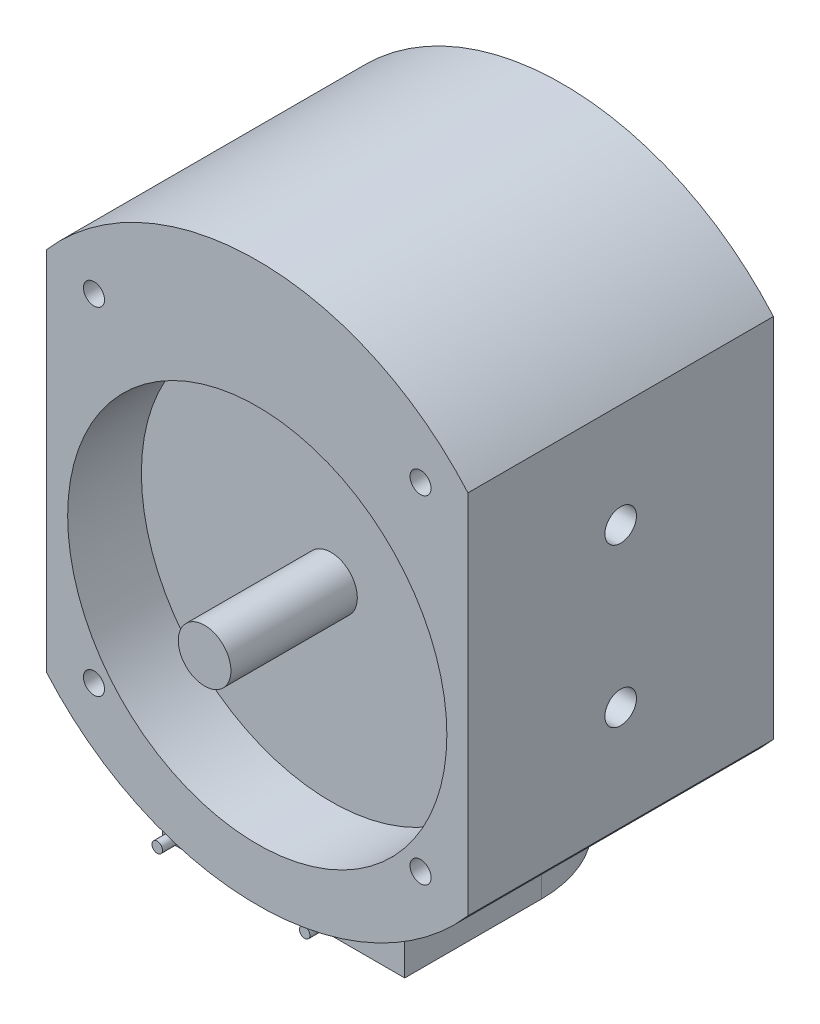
ISO-10303-21;
HEADER;
FILE_DESCRIPTION(('STEP AP214'),'2;1');
FILE_NAME('part.step','',(''),(''),'','','');
FILE_SCHEMA(('AUTOMOTIVE_DESIGN { 1 0 10303 214 1 1 1 1 }'));
ENDSEC;
DATA;
#1=APPLICATION_CONTEXT('core data for automotive mechanical design processes');
#2=APPLICATION_PROTOCOL_DEFINITION('international standard','automotive_design',2000,#1);
#3=PRODUCT_CONTEXT('',#1,'mechanical');
#4=PRODUCT('Part','Part','',(#3));
#5=PRODUCT_RELATED_PRODUCT_CATEGORY('part','',(#4));
#6=PRODUCT_DEFINITION_FORMATION('','',#4);
#7=PRODUCT_DEFINITION_CONTEXT('part definition',#1,'design');
#8=PRODUCT_DEFINITION('design','',#6,#7);
#9=PRODUCT_DEFINITION_SHAPE('','',#8);
#10=(LENGTH_UNIT() NAMED_UNIT(*) SI_UNIT(.MILLI.,.METRE.));
#11=(NAMED_UNIT(*) PLANE_ANGLE_UNIT() SI_UNIT($,.RADIAN.));
#12=(NAMED_UNIT(*) SI_UNIT($,.STERADIAN.) SOLID_ANGLE_UNIT());
#13=UNCERTAINTY_MEASURE_WITH_UNIT(LENGTH_MEASURE(1.E-05),#10,'distance_accuracy_value','');
#14=(GEOMETRIC_REPRESENTATION_CONTEXT(3) GLOBAL_UNCERTAINTY_ASSIGNED_CONTEXT((#13)) GLOBAL_UNIT_ASSIGNED_CONTEXT((#10,
#11,#12)) REPRESENTATION_CONTEXT('',''));
#15=CARTESIAN_POINT('',(0.,0.,0.));
#16=DIRECTION('',(0.,0.,1.));
#17=DIRECTION('',(1.,0.,0.));
#18=AXIS2_PLACEMENT_3D('',#15,#16,#17);
#19=CARTESIAN_POINT('',(0.,0.,5.));
#20=DIRECTION('',(0.,0.,1.));
#21=DIRECTION('',(1.,0.,0.));
#22=AXIS2_PLACEMENT_3D('',#19,#20,#21);
#23=PLANE('',#22);
#24=CARTESIAN_POINT('',(0.,0.,5.));
#25=DIRECTION('',(0.,0.,1.));
#26=DIRECTION('',(1.,0.,0.));
#27=AXIS2_PLACEMENT_3D('',#24,#25,#26);
#28=CIRCLE('',#27,2.5);
#29=CARTESIAN_POINT('',(2.5,0.,5.));
#30=VERTEX_POINT('',#29);
#31=EDGE_CURVE('E20',#30,#30,#28,.F.);
#32=ORIENTED_EDGE('',*,*,#31,.F.);
#33=EDGE_LOOP('',(#32));
#34=FACE_BOUND('',#33,.T.);
#35=ADVANCED_FACE('F17',(#34),#23,.T.);
#36=CARTESIAN_POINT('',(0.,0.,-46.0710678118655));
#37=DIRECTION('',(0.,0.,1.));
#38=DIRECTION('',(1.,0.,0.));
#39=AXIS2_PLACEMENT_3D('',#36,#37,#38);
#40=CYLINDRICAL_SURFACE('',#39,2.5);
#41=CARTESIAN_POINT('',(0.,0.,-7.));
#42=DIRECTION('',(0.,0.,1.));
#43=DIRECTION('',(1.,0.,0.));
#44=AXIS2_PLACEMENT_3D('',#41,#42,#43);
#45=CIRCLE('',#44,2.5);
#46=CARTESIAN_POINT('',(2.5,0.,-7.));
#47=VERTEX_POINT('',#46);
#48=EDGE_CURVE('E619',#47,#47,#45,.F.);
#49=ORIENTED_EDGE('',*,*,#48,.F.);
#50=EDGE_LOOP('',(#49));
#51=FACE_BOUND('',#50,.T.);
#52=ORIENTED_EDGE('',*,*,#31,.T.);
#53=EDGE_LOOP('',(#52));
#54=FACE_BOUND('',#53,.T.);
#55=ADVANCED_FACE('F503',(#51,#54),#40,.T.);
#56=CARTESIAN_POINT('',(-11.5,-25.,-2.));
#57=DIRECTION('',(0.,0.,1.));
#58=DIRECTION('',(1.,0.,0.));
#59=AXIS2_PLACEMENT_3D('',#56,#57,#58);
#60=PLANE('',#59);
#61=CARTESIAN_POINT('',(-11.5,-25.,-2.));
#62=DIRECTION('',(0.,0.,-1.));
#63=DIRECTION('',(-1.,0.,0.));
#64=AXIS2_PLACEMENT_3D('',#61,#62,#63);
#65=CIRCLE('',#64,0.5);
#66=CARTESIAN_POINT('',(-12.,-25.,-2.));
#67=VERTEX_POINT('',#66);
#68=EDGE_CURVE('E621',#67,#67,#65,.T.);
#69=ORIENTED_EDGE('',*,*,#68,.F.);
#70=EDGE_LOOP('',(#69));
#71=FACE_BOUND('',#70,.T.);
#72=ADVANCED_FACE('F495',(#71),#60,.T.);
#73=CARTESIAN_POINT('',(2.5,-25.,-2.));
#74=DIRECTION('',(0.,0.,1.));
#75=DIRECTION('',(1.,0.,0.));
#76=AXIS2_PLACEMENT_3D('',#73,#74,#75);
#77=PLANE('',#76);
#78=CARTESIAN_POINT('',(2.5,-25.,-2.));
#79=DIRECTION('',(0.,0.,-1.));
#80=DIRECTION('',(-1.,0.,0.));
#81=AXIS2_PLACEMENT_3D('',#78,#79,#80);
#82=CIRCLE('',#81,0.5);
#83=CARTESIAN_POINT('',(2.,-25.,-2.));
#84=VERTEX_POINT('',#83);
#85=EDGE_CURVE('E624',#84,#84,#82,.T.);
#86=ORIENTED_EDGE('',*,*,#85,.F.);
#87=EDGE_LOOP('',(#86));
#88=FACE_BOUND('',#87,.T.);
#89=ADVANCED_FACE('F487',(#88),#77,.T.);
#90=CARTESIAN_POINT('',(15.5,19.5,-5.));
#91=DIRECTION('',(0.,0.,-1.));
#92=DIRECTION('',(-1.,0.,0.));
#93=AXIS2_PLACEMENT_3D('',#90,#91,#92);
#94=PLANE('',#93);
#95=CARTESIAN_POINT('',(15.5,19.5,-5.));
#96=DIRECTION('',(0.,0.,1.));
#97=DIRECTION('',(1.,0.,0.));
#98=AXIS2_PLACEMENT_3D('',#95,#96,#97);
#99=CIRCLE('',#98,0.999999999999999);
#100=CARTESIAN_POINT('',(16.5,19.5,-5.));
#101=VERTEX_POINT('',#100);
#102=EDGE_CURVE('E629',#101,#101,#99,.T.);
#103=ORIENTED_EDGE('',*,*,#102,.T.);
#104=EDGE_LOOP('',(#103));
#105=FACE_BOUND('',#104,.T.);
#106=ADVANCED_FACE('F479',(#105),#94,.F.);
#107=CARTESIAN_POINT('',(15.5,-12.5,-5.));
#108=DIRECTION('',(0.,0.,1.));
#109=DIRECTION('',(1.,0.,0.));
#110=AXIS2_PLACEMENT_3D('',#107,#108,#109);
#111=PLANE('',#110);
#112=CARTESIAN_POINT('',(15.5,-12.5,-5.));
#113=DIRECTION('',(0.,0.,1.));
#114=DIRECTION('',(1.,0.,0.));
#115=AXIS2_PLACEMENT_3D('',#112,#113,#114);
#116=CIRCLE('',#115,0.999999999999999);
#117=CARTESIAN_POINT('',(16.5,-12.5,-5.));
#118=VERTEX_POINT('',#117);
#119=EDGE_CURVE('E632',#118,#118,#116,.T.);
#120=ORIENTED_EDGE('',*,*,#119,.T.);
#121=EDGE_LOOP('',(#120));
#122=FACE_BOUND('',#121,.T.);
#123=ADVANCED_FACE('F471',(#122),#111,.T.);
#124=CARTESIAN_POINT('',(-15.5,-12.5,-5.));
#125=DIRECTION('',(0.,0.,-1.));
#126=DIRECTION('',(-1.,0.,0.));
#127=AXIS2_PLACEMENT_3D('',#124,#125,#126);
#128=PLANE('',#127);
#129=CARTESIAN_POINT('',(-15.5,-12.5,-5.));
#130=DIRECTION('',(0.,0.,1.));
#131=DIRECTION('',(1.,0.,0.));
#132=AXIS2_PLACEMENT_3D('',#129,#130,#131);
#133=CIRCLE('',#132,0.999999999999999);
#134=CARTESIAN_POINT('',(-14.5,-12.5,-5.));
#135=VERTEX_POINT('',#134);
#136=EDGE_CURVE('E635',#135,#135,#133,.T.);
#137=ORIENTED_EDGE('',*,*,#136,.T.);
#138=EDGE_LOOP('',(#137));
#139=FACE_BOUND('',#138,.T.);
#140=ADVANCED_FACE('F463',(#139),#128,.F.);
#141=CARTESIAN_POINT('',(-15.5,19.5,-5.));
#142=DIRECTION('',(0.,0.,1.));
#143=DIRECTION('',(1.,0.,0.));
#144=AXIS2_PLACEMENT_3D('',#141,#142,#143);
#145=PLANE('',#144);
#146=CARTESIAN_POINT('',(-15.5,19.5,-5.));
#147=DIRECTION('',(0.,0.,1.));
#148=DIRECTION('',(1.,0.,0.));
#149=AXIS2_PLACEMENT_3D('',#146,#147,#148);
#150=CIRCLE('',#149,0.999999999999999);
#151=CARTESIAN_POINT('',(-14.5,19.5,-5.));
#152=VERTEX_POINT('',#151);
#153=EDGE_CURVE('E638',#152,#152,#150,.T.);
#154=ORIENTED_EDGE('',*,*,#153,.T.);
#155=EDGE_LOOP('',(#154));
#156=FACE_BOUND('',#155,.T.);
#157=ADVANCED_FACE('F455',(#156),#145,.T.);
#158=CARTESIAN_POINT('',(0.,0.,-7.));
#159=DIRECTION('',(0.,0.,1.));
#160=DIRECTION('',(1.,0.,0.));
#161=AXIS2_PLACEMENT_3D('',#158,#159,#160);
#162=PLANE('',#161);
#163=ORIENTED_EDGE('',*,*,#48,.T.);
#164=EDGE_LOOP('',(#163));
#165=FACE_BOUND('',#164,.T.);
#166=CARTESIAN_POINT('',(0.,0.,-7.));
#167=DIRECTION('',(0.,0.,1.));
#168=DIRECTION('',(1.,0.,0.));
#169=AXIS2_PLACEMENT_3D('',#166,#167,#168);
#170=CIRCLE('',#169,18.);
#171=CARTESIAN_POINT('',(18.,0.,-7.));
#172=VERTEX_POINT('',#171);
#173=EDGE_CURVE('E641',#172,#172,#170,.T.);
#174=ORIENTED_EDGE('',*,*,#173,.T.);
#175=EDGE_LOOP('',(#174));
#176=FACE_BOUND('',#175,.T.);
#177=ADVANCED_FACE('F447',(#165,#176),#162,.T.);
#178=CARTESIAN_POINT('',(15.,-4.00000000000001,-14.5));
#179=DIRECTION('',(1.,0.,0.));
#180=DIRECTION('',(0.,0.,-1.));
#181=AXIS2_PLACEMENT_3D('',#178,#179,#180);
#182=PLANE('',#181);
#183=CARTESIAN_POINT('',(15.,-4.00000000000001,-14.5));
#184=DIRECTION('',(1.,0.,0.));
#185=DIRECTION('',(0.,0.,-1.));
#186=AXIS2_PLACEMENT_3D('',#183,#184,#185);
#187=CIRCLE('',#186,1.5);
#188=CARTESIAN_POINT('',(15.,-4.00000000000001,-16.));
#189=VERTEX_POINT('',#188);
#190=EDGE_CURVE('E644',#189,#189,#187,.T.);
#191=ORIENTED_EDGE('',*,*,#190,.T.);
#192=EDGE_LOOP('',(#191));
#193=FACE_BOUND('',#192,.T.);
#194=ADVANCED_FACE('F439',(#193),#182,.T.);
#195=CARTESIAN_POINT('',(15.,11.,-14.5));
#196=DIRECTION('',(1.,0.,0.));
#197=DIRECTION('',(0.,0.,-1.));
#198=AXIS2_PLACEMENT_3D('',#195,#196,#197);
#199=PLANE('',#198);
#200=CARTESIAN_POINT('',(15.,11.,-14.5));
#201=DIRECTION('',(1.,0.,0.));
#202=DIRECTION('',(0.,0.,-1.));
#203=AXIS2_PLACEMENT_3D('',#200,#201,#202);
#204=CIRCLE('',#203,1.5);
#205=CARTESIAN_POINT('',(15.,11.,-16.));
#206=VERTEX_POINT('',#205);
#207=EDGE_CURVE('E647',#206,#206,#204,.T.);
#208=ORIENTED_EDGE('',*,*,#207,.T.);
#209=EDGE_LOOP('',(#208));
#210=FACE_BOUND('',#209,.T.);
#211=ADVANCED_FACE('F431',(#210),#199,.T.);
#212=CARTESIAN_POINT('',(-15.,-4.,-14.5));
#213=DIRECTION('',(-1.,0.,0.));
#214=DIRECTION('',(0.,0.,1.));
#215=AXIS2_PLACEMENT_3D('',#212,#213,#214);
#216=PLANE('',#215);
#217=CARTESIAN_POINT('',(-15.,-4.,-14.5));
#218=DIRECTION('',(-1.,0.,0.));
#219=DIRECTION('',(0.,0.,1.));
#220=AXIS2_PLACEMENT_3D('',#217,#218,#219);
#221=CIRCLE('',#220,1.5);
#222=CARTESIAN_POINT('',(-15.,-4.,-13.));
#223=VERTEX_POINT('',#222);
#224=EDGE_CURVE('E650',#223,#223,#221,.T.);
#225=ORIENTED_EDGE('',*,*,#224,.T.);
#226=EDGE_LOOP('',(#225));
#227=FACE_BOUND('',#226,.T.);
#228=ADVANCED_FACE('F423',(#227),#216,.T.);
#229=CARTESIAN_POINT('',(-15.,11.,-14.5));
#230=DIRECTION('',(-1.,0.,0.));
#231=DIRECTION('',(0.,0.,1.));
#232=AXIS2_PLACEMENT_3D('',#229,#230,#231);
#233=PLANE('',#232);
#234=CARTESIAN_POINT('',(-15.,11.,-14.5));
#235=DIRECTION('',(-1.,0.,0.));
#236=DIRECTION('',(0.,0.,1.));
#237=AXIS2_PLACEMENT_3D('',#234,#235,#236);
#238=CIRCLE('',#237,1.5);
#239=CARTESIAN_POINT('',(-15.,11.,-13.));
#240=VERTEX_POINT('',#239);
#241=EDGE_CURVE('E653',#240,#240,#238,.T.);
#242=ORIENTED_EDGE('',*,*,#241,.T.);
#243=EDGE_LOOP('',(#242));
#244=FACE_BOUND('',#243,.T.);
#245=ADVANCED_FACE('F415',(#244),#233,.T.);
#246=CARTESIAN_POINT('',(-11.5,-25.,-2.));
#247=DIRECTION('',(0.,0.,-1.));
#248=DIRECTION('',(-1.,0.,0.));
#249=AXIS2_PLACEMENT_3D('',#246,#247,#248);
#250=CYLINDRICAL_SURFACE('',#249,0.5);
#251=CARTESIAN_POINT('',(-11.5,-25.,-7.));
#252=DIRECTION('',(0.,0.,-1.));
#253=DIRECTION('',(-1.,0.,0.));
#254=AXIS2_PLACEMENT_3D('',#251,#252,#253);
#255=CIRCLE('',#254,0.5);
#256=CARTESIAN_POINT('',(-12.,-25.,-7.));
#257=VERTEX_POINT('',#256);
#258=EDGE_CURVE('E656',#257,#257,#255,.T.);
#259=ORIENTED_EDGE('',*,*,#258,.F.);
#260=EDGE_LOOP('',(#259));
#261=FACE_BOUND('',#260,.T.);
#262=ORIENTED_EDGE('',*,*,#68,.T.);
#263=EDGE_LOOP('',(#262));
#264=FACE_BOUND('',#263,.T.);
#265=ADVANCED_FACE('F407',(#261,#264),#250,.T.);
#266=CARTESIAN_POINT('',(2.5,-25.,-2.));
#267=DIRECTION('',(0.,0.,-1.));
#268=DIRECTION('',(-1.,0.,0.));
#269=AXIS2_PLACEMENT_3D('',#266,#267,#268);
#270=CYLINDRICAL_SURFACE('',#269,0.5);
#271=CARTESIAN_POINT('',(2.5,-25.,-7.));
#272=DIRECTION('',(0.,0.,-1.));
#273=DIRECTION('',(-1.,0.,0.));
#274=AXIS2_PLACEMENT_3D('',#271,#272,#273);
#275=CIRCLE('',#274,0.5);
#276=CARTESIAN_POINT('',(2.,-25.,-7.));
#277=VERTEX_POINT('',#276);
#278=EDGE_CURVE('E659',#277,#277,#275,.T.);
#279=ORIENTED_EDGE('',*,*,#278,.F.);
#280=EDGE_LOOP('',(#279));
#281=FACE_BOUND('',#280,.T.);
#282=ORIENTED_EDGE('',*,*,#85,.T.);
#283=EDGE_LOOP('',(#282));
#284=FACE_BOUND('',#283,.T.);
#285=ADVANCED_FACE('F399',(#281,#284),#270,.T.);
#286=CARTESIAN_POINT('',(15.5,19.5,-5.));
#287=DIRECTION('',(0.,0.,1.));
#288=DIRECTION('',(1.,0.,0.));
#289=AXIS2_PLACEMENT_3D('',#286,#287,#288);
#290=CYLINDRICAL_SURFACE('',#289,0.999999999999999);
#291=CARTESIAN_POINT('',(15.5,19.5,0.));
#292=DIRECTION('',(0.,0.,1.));
#293=DIRECTION('',(1.,0.,0.));
#294=AXIS2_PLACEMENT_3D('',#291,#292,#293);
#295=CIRCLE('',#294,0.999999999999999);
#296=CARTESIAN_POINT('',(16.5,19.5,0.));
#297=VERTEX_POINT('',#296);
#298=EDGE_CURVE('E662',#297,#297,#295,.F.);
#299=ORIENTED_EDGE('',*,*,#298,.F.);
#300=EDGE_LOOP('',(#299));
#301=FACE_BOUND('',#300,.T.);
#302=ORIENTED_EDGE('',*,*,#102,.F.);
#303=EDGE_LOOP('',(#302));
#304=FACE_BOUND('',#303,.T.);
#305=ADVANCED_FACE('F391',(#301,#304),#290,.F.);
#306=CARTESIAN_POINT('',(15.5,-12.5,-5.));
#307=DIRECTION('',(0.,0.,1.));
#308=DIRECTION('',(1.,0.,0.));
#309=AXIS2_PLACEMENT_3D('',#306,#307,#308);
#310=CYLINDRICAL_SURFACE('',#309,0.999999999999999);
#311=CARTESIAN_POINT('',(15.5,-12.5,0.));
#312=DIRECTION('',(0.,0.,1.));
#313=DIRECTION('',(1.,0.,0.));
#314=AXIS2_PLACEMENT_3D('',#311,#312,#313);
#315=CIRCLE('',#314,0.999999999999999);
#316=CARTESIAN_POINT('',(16.5,-12.5,0.));
#317=VERTEX_POINT('',#316);
#318=EDGE_CURVE('E665',#317,#317,#315,.F.);
#319=ORIENTED_EDGE('',*,*,#318,.F.);
#320=EDGE_LOOP('',(#319));
#321=FACE_BOUND('',#320,.T.);
#322=ORIENTED_EDGE('',*,*,#119,.F.);
#323=EDGE_LOOP('',(#322));
#324=FACE_BOUND('',#323,.T.);
#325=ADVANCED_FACE('F383',(#321,#324),#310,.F.);
#326=CARTESIAN_POINT('',(-15.5,-12.5,-5.));
#327=DIRECTION('',(0.,0.,1.));
#328=DIRECTION('',(1.,0.,0.));
#329=AXIS2_PLACEMENT_3D('',#326,#327,#328);
#330=CYLINDRICAL_SURFACE('',#329,0.999999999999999);
#331=CARTESIAN_POINT('',(-15.5,-12.5,0.));
#332=DIRECTION('',(0.,0.,1.));
#333=DIRECTION('',(1.,0.,0.));
#334=AXIS2_PLACEMENT_3D('',#331,#332,#333);
#335=CIRCLE('',#334,0.999999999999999);
#336=CARTESIAN_POINT('',(-14.5,-12.5,0.));
#337=VERTEX_POINT('',#336);
#338=EDGE_CURVE('E668',#337,#337,#335,.F.);
#339=ORIENTED_EDGE('',*,*,#338,.F.);
#340=EDGE_LOOP('',(#339));
#341=FACE_BOUND('',#340,.T.);
#342=ORIENTED_EDGE('',*,*,#136,.F.);
#343=EDGE_LOOP('',(#342));
#344=FACE_BOUND('',#343,.T.);
#345=ADVANCED_FACE('F375',(#341,#344),#330,.F.);
#346=CARTESIAN_POINT('',(-15.5,19.5,-5.));
#347=DIRECTION('',(0.,0.,1.));
#348=DIRECTION('',(1.,0.,0.));
#349=AXIS2_PLACEMENT_3D('',#346,#347,#348);
#350=CYLINDRICAL_SURFACE('',#349,0.999999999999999);
#351=CARTESIAN_POINT('',(-15.5,19.5,0.));
#352=DIRECTION('',(0.,0.,1.));
#353=DIRECTION('',(1.,0.,0.));
#354=AXIS2_PLACEMENT_3D('',#351,#352,#353);
#355=CIRCLE('',#354,0.999999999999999);
#356=CARTESIAN_POINT('',(-14.5,19.5,0.));
#357=VERTEX_POINT('',#356);
#358=EDGE_CURVE('E671',#357,#357,#355,.F.);
#359=ORIENTED_EDGE('',*,*,#358,.F.);
#360=EDGE_LOOP('',(#359));
#361=FACE_BOUND('',#360,.T.);
#362=ORIENTED_EDGE('',*,*,#153,.F.);
#363=EDGE_LOOP('',(#362));
#364=FACE_BOUND('',#363,.T.);
#365=ADVANCED_FACE('F367',(#361,#364),#350,.F.);
#366=CARTESIAN_POINT('',(0.,0.,-7.));
#367=DIRECTION('',(0.,0.,1.));
#368=DIRECTION('',(1.,0.,0.));
#369=AXIS2_PLACEMENT_3D('',#366,#367,#368);
#370=CYLINDRICAL_SURFACE('',#369,18.);
#371=CARTESIAN_POINT('',(0.,0.,0.));
#372=DIRECTION('',(0.,0.,1.));
#373=DIRECTION('',(1.,0.,0.));
#374=AXIS2_PLACEMENT_3D('',#371,#372,#373);
#375=CIRCLE('',#374,18.);
#376=CARTESIAN_POINT('',(18.,0.,0.));
#377=VERTEX_POINT('',#376);
#378=EDGE_CURVE('E674',#377,#377,#375,.F.);
#379=ORIENTED_EDGE('',*,*,#378,.F.);
#380=EDGE_LOOP('',(#379));
#381=FACE_BOUND('',#380,.T.);
#382=ORIENTED_EDGE('',*,*,#173,.F.);
#383=EDGE_LOOP('',(#382));
#384=FACE_BOUND('',#383,.T.);
#385=ADVANCED_FACE('F359',(#381,#384),#370,.F.);
#386=CARTESIAN_POINT('',(-15.5,19.5,-24.));
#387=DIRECTION('',(0.,0.,1.));
#388=DIRECTION('',(1.,0.,0.));
#389=AXIS2_PLACEMENT_3D('',#386,#387,#388);
#390=PLANE('',#389);
#391=CARTESIAN_POINT('',(-15.5,19.5,-24.));
#392=DIRECTION('',(0.,0.,-1.));
#393=DIRECTION('',(-1.,0.,0.));
#394=AXIS2_PLACEMENT_3D('',#391,#392,#393);
#395=CIRCLE('',#394,0.999999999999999);
#396=CARTESIAN_POINT('',(-16.5,19.5,-24.));
#397=VERTEX_POINT('',#396);
#398=EDGE_CURVE('E678',#397,#397,#395,.T.);
#399=ORIENTED_EDGE('',*,*,#398,.T.);
#400=EDGE_LOOP('',(#399));
#401=FACE_BOUND('',#400,.T.);
#402=ADVANCED_FACE('F351',(#401),#390,.F.);
#403=CARTESIAN_POINT('',(-15.5,-12.5,-24.));
#404=DIRECTION('',(0.,0.,-1.));
#405=DIRECTION('',(-1.,0.,0.));
#406=AXIS2_PLACEMENT_3D('',#403,#404,#405);
#407=PLANE('',#406);
#408=CARTESIAN_POINT('',(-15.5,-12.5,-24.));
#409=DIRECTION('',(0.,0.,-1.));
#410=DIRECTION('',(-1.,0.,0.));
#411=AXIS2_PLACEMENT_3D('',#408,#409,#410);
#412=CIRCLE('',#411,0.999999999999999);
#413=CARTESIAN_POINT('',(-16.5,-12.5,-24.));
#414=VERTEX_POINT('',#413);
#415=EDGE_CURVE('E681',#414,#414,#412,.T.);
#416=ORIENTED_EDGE('',*,*,#415,.T.);
#417=EDGE_LOOP('',(#416));
#418=FACE_BOUND('',#417,.T.);
#419=ADVANCED_FACE('F343',(#418),#407,.T.);
#420=CARTESIAN_POINT('',(15.5,-12.5,-24.));
#421=DIRECTION('',(0.,0.,1.));
#422=DIRECTION('',(1.,0.,0.));
#423=AXIS2_PLACEMENT_3D('',#420,#421,#422);
#424=PLANE('',#423);
#425=CARTESIAN_POINT('',(15.5,-12.5,-24.));
#426=DIRECTION('',(0.,0.,-1.));
#427=DIRECTION('',(-1.,0.,0.));
#428=AXIS2_PLACEMENT_3D('',#425,#426,#427);
#429=CIRCLE('',#428,0.999999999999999);
#430=CARTESIAN_POINT('',(14.5,-12.5,-24.));
#431=VERTEX_POINT('',#430);
#432=EDGE_CURVE('E684',#431,#431,#429,.T.);
#433=ORIENTED_EDGE('',*,*,#432,.T.);
#434=EDGE_LOOP('',(#433));
#435=FACE_BOUND('',#434,.T.);
#436=ADVANCED_FACE('F335',(#435),#424,.F.);
#437=CARTESIAN_POINT('',(15.5,19.5,-24.));
#438=DIRECTION('',(0.,0.,-1.));
#439=DIRECTION('',(-1.,0.,0.));
#440=AXIS2_PLACEMENT_3D('',#437,#438,#439);
#441=PLANE('',#440);
#442=CARTESIAN_POINT('',(15.5,19.5,-24.));
#443=DIRECTION('',(0.,0.,-1.));
#444=DIRECTION('',(-1.,0.,0.));
#445=AXIS2_PLACEMENT_3D('',#442,#443,#444);
#446=CIRCLE('',#445,0.999999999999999);
#447=CARTESIAN_POINT('',(14.5,19.5,-24.));
#448=VERTEX_POINT('',#447);
#449=EDGE_CURVE('E687',#448,#448,#446,.T.);
#450=ORIENTED_EDGE('',*,*,#449,.T.);
#451=EDGE_LOOP('',(#450));
#452=FACE_BOUND('',#451,.T.);
#453=ADVANCED_FACE('F327',(#452),#441,.T.);
#454=CARTESIAN_POINT('',(0.,3.5,-34.));
#455=DIRECTION('',(0.,0.,1.));
#456=DIRECTION('',(1.,0.,0.));
#457=AXIS2_PLACEMENT_3D('',#454,#455,#456);
#458=PLANE('',#457);
#459=CARTESIAN_POINT('',(0.,0.,-34.));
#460=DIRECTION('',(0.,0.,1.));
#461=DIRECTION('',(1.,0.,0.));
#462=AXIS2_PLACEMENT_3D('',#459,#460,#461);
#463=CIRCLE('',#462,2.5);
#464=CARTESIAN_POINT('',(2.5,0.,-34.));
#465=VERTEX_POINT('',#464);
#466=EDGE_CURVE('E690',#465,#465,#463,.T.);
#467=ORIENTED_EDGE('',*,*,#466,.F.);
#468=EDGE_LOOP('',(#467));
#469=FACE_BOUND('',#468,.T.);
#470=ADVANCED_FACE('F319',(#469),#458,.F.);
#471=CARTESIAN_POINT('',(15.,-4.00000000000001,-14.5));
#472=DIRECTION('',(1.,0.,0.));
#473=DIRECTION('',(0.,0.,-1.));
#474=AXIS2_PLACEMENT_3D('',#471,#472,#473);
#475=CYLINDRICAL_SURFACE('',#474,1.5);
#476=ORIENTED_EDGE('',*,*,#190,.F.);
#477=EDGE_LOOP('',(#476));
#478=FACE_BOUND('',#477,.T.);
#479=CARTESIAN_POINT('',(20.,-4.00000000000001,-14.5));
#480=DIRECTION('',(1.,0.,0.));
#481=DIRECTION('',(0.,0.,-1.));
#482=AXIS2_PLACEMENT_3D('',#479,#480,#481);
#483=CIRCLE('',#482,1.5);
#484=CARTESIAN_POINT('',(20.,-4.00000000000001,-16.));
#485=VERTEX_POINT('',#484);
#486=EDGE_CURVE('E696',#485,#485,#483,.T.);
#487=ORIENTED_EDGE('',*,*,#486,.T.);
#488=EDGE_LOOP('',(#487));
#489=FACE_BOUND('',#488,.T.);
#490=ADVANCED_FACE('F311',(#478,#489),#475,.F.);
#491=CARTESIAN_POINT('',(15.,11.,-14.5));
#492=DIRECTION('',(1.,0.,0.));
#493=DIRECTION('',(0.,0.,-1.));
#494=AXIS2_PLACEMENT_3D('',#491,#492,#493);
#495=CYLINDRICAL_SURFACE('',#494,1.5);
#496=ORIENTED_EDGE('',*,*,#207,.F.);
#497=EDGE_LOOP('',(#496));
#498=FACE_BOUND('',#497,.T.);
#499=CARTESIAN_POINT('',(20.,11.,-14.5));
#500=DIRECTION('',(1.,0.,0.));
#501=DIRECTION('',(0.,0.,-1.));
#502=AXIS2_PLACEMENT_3D('',#499,#500,#501);
#503=CIRCLE('',#502,1.5);
#504=CARTESIAN_POINT('',(20.,11.,-16.));
#505=VERTEX_POINT('',#504);
#506=EDGE_CURVE('E699',#505,#505,#503,.T.);
#507=ORIENTED_EDGE('',*,*,#506,.T.);
#508=EDGE_LOOP('',(#507));
#509=FACE_BOUND('',#508,.T.);
#510=ADVANCED_FACE('F303',(#498,#509),#495,.F.);
#511=CARTESIAN_POINT('',(-15.,-4.,-14.5));
#512=DIRECTION('',(-1.,0.,0.));
#513=DIRECTION('',(0.,0.,1.));
#514=AXIS2_PLACEMENT_3D('',#511,#512,#513);
#515=CYLINDRICAL_SURFACE('',#514,1.5);
#516=CARTESIAN_POINT('',(-20.,-4.,-14.5));
#517=DIRECTION('',(-1.,0.,0.));
#518=DIRECTION('',(0.,0.,1.));
#519=AXIS2_PLACEMENT_3D('',#516,#517,#518);
#520=CIRCLE('',#519,1.5);
#521=CARTESIAN_POINT('',(-20.,-4.,-13.));
#522=VERTEX_POINT('',#521);
#523=EDGE_CURVE('E705',#522,#522,#520,.F.);
#524=ORIENTED_EDGE('',*,*,#523,.F.);
#525=EDGE_LOOP('',(#524));
#526=FACE_BOUND('',#525,.T.);
#527=ORIENTED_EDGE('',*,*,#224,.F.);
#528=EDGE_LOOP('',(#527));
#529=FACE_BOUND('',#528,.T.);
#530=ADVANCED_FACE('F295',(#526,#529),#515,.F.);
#531=CARTESIAN_POINT('',(-15.,11.,-14.5));
#532=DIRECTION('',(-1.,0.,0.));
#533=DIRECTION('',(0.,0.,1.));
#534=AXIS2_PLACEMENT_3D('',#531,#532,#533);
#535=CYLINDRICAL_SURFACE('',#534,1.5);
#536=CARTESIAN_POINT('',(-20.,11.,-14.5));
#537=DIRECTION('',(-1.,0.,0.));
#538=DIRECTION('',(0.,0.,1.));
#539=AXIS2_PLACEMENT_3D('',#536,#537,#538);
#540=CIRCLE('',#539,1.5);
#541=CARTESIAN_POINT('',(-20.,11.,-13.));
#542=VERTEX_POINT('',#541);
#543=EDGE_CURVE('E708',#542,#542,#540,.F.);
#544=ORIENTED_EDGE('',*,*,#543,.F.);
#545=EDGE_LOOP('',(#544));
#546=FACE_BOUND('',#545,.T.);
#547=ORIENTED_EDGE('',*,*,#241,.F.);
#548=EDGE_LOOP('',(#547));
#549=FACE_BOUND('',#548,.T.);
#550=ADVANCED_FACE('F287',(#546,#549),#535,.F.);
#551=CARTESIAN_POINT('',(0.,0.,-7.));
#552=DIRECTION('',(0.,0.,1.));
#553=DIRECTION('',(1.,0.,0.));
#554=AXIS2_PLACEMENT_3D('',#551,#552,#553);
#555=PLANE('',#554);
#556=ORIENTED_EDGE('',*,*,#278,.T.);
#557=EDGE_LOOP('',(#556));
#558=FACE_BOUND('',#557,.T.);
#559=DIRECTION('',(0.,1.,0.));
#560=VECTOR('',#559,1.);
#561=CARTESIAN_POINT('',(-16.,-17.6246301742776,-7.));
#562=LINE('',#561,#560);
#563=CARTESIAN_POINT('',(-16.,-29.,-7.));
#564=VERTEX_POINT('',#563);
#565=CARTESIAN_POINT('',(-16.,-17.6246301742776,-7.));
#566=VERTEX_POINT('',#565);
#567=EDGE_CURVE('E677',#564,#566,#562,.T.);
#568=ORIENTED_EDGE('',*,*,#567,.F.);
#569=DIRECTION('',(1.,0.,0.));
#570=VECTOR('',#569,1.);
#571=CARTESIAN_POINT('',(-16.,-29.,-7.));
#572=LINE('',#571,#570);
#573=CARTESIAN_POINT('',(7.,-29.,-7.));
#574=VERTEX_POINT('',#573);
#575=EDGE_CURVE('E733',#574,#564,#572,.F.);
#576=ORIENTED_EDGE('',*,*,#575,.F.);
#577=DIRECTION('',(0.,1.,0.));
#578=VECTOR('',#577,1.);
#579=CARTESIAN_POINT('',(7.,-17.6246301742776,-7.));
#580=LINE('',#579,#578);
#581=CARTESIAN_POINT('',(7.,-22.0587558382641,-7.));
#582=VERTEX_POINT('',#581);
#583=EDGE_CURVE('E88',#582,#574,#580,.F.);
#584=ORIENTED_EDGE('',*,*,#583,.F.);
#585=CARTESIAN_POINT('',(0.,3.5,-7.));
#586=DIRECTION('',(0.,0.,1.));
#587=DIRECTION('',(1.,0.,0.));
#588=AXIS2_PLACEMENT_3D('',#585,#586,#587);
#589=CIRCLE('',#588,26.5);
#590=EDGE_CURVE('E712',#566,#582,#589,.T.);
#591=ORIENTED_EDGE('',*,*,#590,.F.);
#592=EDGE_LOOP('',(#568,#576,#584,#591));
#593=FACE_BOUND('',#592,.T.);
#594=ORIENTED_EDGE('',*,*,#258,.T.);
#595=EDGE_LOOP('',(#594));
#596=FACE_BOUND('',#595,.T.);
#597=ADVANCED_FACE('F280',(#558,#593,#596),#555,.T.);
#598=CARTESIAN_POINT('',(7.,-17.6246301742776,-54.659287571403));
#599=DIRECTION('',(1.,0.,0.));
#600=DIRECTION('',(0.,1.,0.));
#601=AXIS2_PLACEMENT_3D('',#598,#599,#600);
#602=PLANE('',#601);
#603=ORIENTED_EDGE('',*,*,#583,.T.);
#604=DIRECTION('',(0.,0.,1.));
#605=VECTOR('',#604,1.);
#606=CARTESIAN_POINT('',(7.,-29.,-54.659287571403));
#607=LINE('',#606,#605);
#608=CARTESIAN_POINT('',(7.,-29.,-20.));
#609=VERTEX_POINT('',#608);
#610=EDGE_CURVE('E734',#609,#574,#607,.T.);
#611=ORIENTED_EDGE('',*,*,#610,.F.);
#612=DIRECTION('',(0.,-1.,0.));
#613=VECTOR('',#612,1.);
#614=CARTESIAN_POINT('',(6.99999999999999,30.001,-20.));
#615=LINE('',#614,#613);
#616=CARTESIAN_POINT('',(7.,-22.0587558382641,-20.));
#617=VERTEX_POINT('',#616);
#618=EDGE_CURVE('E80',#617,#609,#615,.T.);
#619=ORIENTED_EDGE('',*,*,#618,.F.);
#620=DIRECTION('',(0.,0.,1.));
#621=VECTOR('',#620,1.);
#622=CARTESIAN_POINT('',(7.,-22.0587558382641,-29.));
#623=LINE('',#622,#621);
#624=EDGE_CURVE('E714',#582,#617,#623,.F.);
#625=ORIENTED_EDGE('',*,*,#624,.F.);
#626=EDGE_LOOP('',(#603,#611,#619,#625));
#627=FACE_BOUND('',#626,.T.);
#628=ADVANCED_FACE('F272',(#627),#602,.T.);
#629=CARTESIAN_POINT('',(0.,3.5,0.));
#630=DIRECTION('',(0.,0.,1.));
#631=DIRECTION('',(1.,0.,0.));
#632=AXIS2_PLACEMENT_3D('',#629,#630,#631);
#633=PLANE('',#632);
#634=DIRECTION('',(0.,1.,0.));
#635=VECTOR('',#634,1.);
#636=CARTESIAN_POINT('',(-20.,20.8853386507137,0.));
#637=LINE('',#636,#635);
#638=CARTESIAN_POINT('',(-20.,-13.8853386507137,0.));
#639=VERTEX_POINT('',#638);
#640=CARTESIAN_POINT('',(-20.,20.8853386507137,0.));
#641=VERTEX_POINT('',#640);
#642=EDGE_CURVE('E711',#639,#641,#637,.T.);
#643=ORIENTED_EDGE('',*,*,#642,.F.);
#644=CARTESIAN_POINT('',(0.,3.5,0.));
#645=DIRECTION('',(0.,0.,1.));
#646=DIRECTION('',(1.,0.,0.));
#647=AXIS2_PLACEMENT_3D('',#644,#645,#646);
#648=CIRCLE('',#647,26.5);
#649=CARTESIAN_POINT('',(20.,-13.8853386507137,0.));
#650=VERTEX_POINT('',#649);
#651=EDGE_CURVE('E112',#650,#639,#648,.F.);
#652=ORIENTED_EDGE('',*,*,#651,.F.);
#653=DIRECTION('',(0.,1.,0.));
#654=VECTOR('',#653,1.);
#655=CARTESIAN_POINT('',(20.,20.8853386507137,0.));
#656=LINE('',#655,#654);
#657=CARTESIAN_POINT('',(20.,20.8853386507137,0.));
#658=VERTEX_POINT('',#657);
#659=EDGE_CURVE('E108',#650,#658,#656,.T.);
#660=ORIENTED_EDGE('',*,*,#659,.T.);
#661=CARTESIAN_POINT('',(0.,3.5,0.));
#662=DIRECTION('',(0.,0.,1.));
#663=DIRECTION('',(1.,0.,0.));
#664=AXIS2_PLACEMENT_3D('',#661,#662,#663);
#665=CIRCLE('',#664,26.5);
#666=EDGE_CURVE('E702',#641,#658,#665,.F.);
#667=ORIENTED_EDGE('',*,*,#666,.F.);
#668=EDGE_LOOP('',(#643,#652,#660,#667));
#669=FACE_BOUND('',#668,.T.);
#670=ORIENTED_EDGE('',*,*,#378,.T.);
#671=EDGE_LOOP('',(#670));
#672=FACE_BOUND('',#671,.T.);
#673=ORIENTED_EDGE('',*,*,#358,.T.);
#674=EDGE_LOOP('',(#673));
#675=FACE_BOUND('',#674,.T.);
#676=ORIENTED_EDGE('',*,*,#338,.T.);
#677=EDGE_LOOP('',(#676));
#678=FACE_BOUND('',#677,.T.);
#679=ORIENTED_EDGE('',*,*,#318,.T.);
#680=EDGE_LOOP('',(#679));
#681=FACE_BOUND('',#680,.T.);
#682=ORIENTED_EDGE('',*,*,#298,.T.);
#683=EDGE_LOOP('',(#682));
#684=FACE_BOUND('',#683,.T.);
#685=ADVANCED_FACE('F264',(#669,#672,#675,#678,#681,#684),#633,.T.);
#686=CARTESIAN_POINT('',(-16.,-17.6246301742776,-54.659287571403));
#687=DIRECTION('',(-1.,0.,0.));
#688=DIRECTION('',(0.,0.,1.));
#689=AXIS2_PLACEMENT_3D('',#686,#687,#688);
#690=PLANE('',#689);
#691=DIRECTION('',(0.,0.,1.));
#692=VECTOR('',#691,1.);
#693=CARTESIAN_POINT('',(-16.,-29.,-54.659287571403));
#694=LINE('',#693,#692);
#695=CARTESIAN_POINT('',(-16.,-29.,-20.));
#696=VERTEX_POINT('',#695);
#697=EDGE_CURVE('E693',#564,#696,#694,.F.);
#698=ORIENTED_EDGE('',*,*,#697,.F.);
#699=ORIENTED_EDGE('',*,*,#567,.T.);
#700=DIRECTION('',(0.,0.,1.));
#701=VECTOR('',#700,1.);
#702=CARTESIAN_POINT('',(-16.,-17.6246301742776,-29.));
#703=LINE('',#702,#701);
#704=CARTESIAN_POINT('',(-16.,-17.6246301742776,-20.));
#705=VERTEX_POINT('',#704);
#706=EDGE_CURVE('E715',#705,#566,#703,.T.);
#707=ORIENTED_EDGE('',*,*,#706,.F.);
#708=DIRECTION('',(0.,-1.,0.));
#709=VECTOR('',#708,1.);
#710=CARTESIAN_POINT('',(-16.,30.001,-20.));
#711=LINE('',#710,#709);
#712=EDGE_CURVE('E157',#696,#705,#711,.F.);
#713=ORIENTED_EDGE('',*,*,#712,.F.);
#714=EDGE_LOOP('',(#698,#699,#707,#713));
#715=FACE_BOUND('',#714,.T.);
#716=ADVANCED_FACE('F256',(#715),#690,.T.);
#717=CARTESIAN_POINT('',(-15.5,19.5,-24.));
#718=DIRECTION('',(0.,0.,-1.));
#719=DIRECTION('',(-1.,0.,0.));
#720=AXIS2_PLACEMENT_3D('',#717,#718,#719);
#721=CYLINDRICAL_SURFACE('',#720,0.999999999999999);
#722=ORIENTED_EDGE('',*,*,#398,.F.);
#723=EDGE_LOOP('',(#722));
#724=FACE_BOUND('',#723,.T.);
#725=CARTESIAN_POINT('',(-15.5,19.5,-29.));
#726=DIRECTION('',(0.,0.,-1.));
#727=DIRECTION('',(-1.,0.,0.));
#728=AXIS2_PLACEMENT_3D('',#725,#726,#727);
#729=CIRCLE('',#728,0.999999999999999);
#730=CARTESIAN_POINT('',(-16.5,19.5,-29.));
#731=VERTEX_POINT('',#730);
#732=EDGE_CURVE('E148',#731,#731,#729,.T.);
#733=ORIENTED_EDGE('',*,*,#732,.T.);
#734=EDGE_LOOP('',(#733));
#735=FACE_BOUND('',#734,.T.);
#736=ADVANCED_FACE('F248',(#724,#735),#721,.F.);
#737=CARTESIAN_POINT('',(-15.5,-12.5,-24.));
#738=DIRECTION('',(0.,0.,-1.));
#739=DIRECTION('',(-1.,0.,0.));
#740=AXIS2_PLACEMENT_3D('',#737,#738,#739);
#741=CYLINDRICAL_SURFACE('',#740,0.999999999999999);
#742=ORIENTED_EDGE('',*,*,#415,.F.);
#743=EDGE_LOOP('',(#742));
#744=FACE_BOUND('',#743,.T.);
#745=CARTESIAN_POINT('',(-15.5,-12.5,-29.));
#746=DIRECTION('',(0.,0.,-1.));
#747=DIRECTION('',(-1.,0.,0.));
#748=AXIS2_PLACEMENT_3D('',#745,#746,#747);
#749=CIRCLE('',#748,0.999999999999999);
#750=CARTESIAN_POINT('',(-16.5,-12.5,-29.));
#751=VERTEX_POINT('',#750);
#752=EDGE_CURVE('E145',#751,#751,#749,.T.);
#753=ORIENTED_EDGE('',*,*,#752,.T.);
#754=EDGE_LOOP('',(#753));
#755=FACE_BOUND('',#754,.T.);
#756=ADVANCED_FACE('F240',(#744,#755),#741,.F.);
#757=CARTESIAN_POINT('',(15.5,-12.5,-24.));
#758=DIRECTION('',(0.,0.,-1.));
#759=DIRECTION('',(-1.,0.,0.));
#760=AXIS2_PLACEMENT_3D('',#757,#758,#759);
#761=CYLINDRICAL_SURFACE('',#760,0.999999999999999);
#762=ORIENTED_EDGE('',*,*,#432,.F.);
#763=EDGE_LOOP('',(#762));
#764=FACE_BOUND('',#763,.T.);
#765=CARTESIAN_POINT('',(15.5,-12.5,-29.));
#766=DIRECTION('',(0.,0.,-1.));
#767=DIRECTION('',(-1.,0.,0.));
#768=AXIS2_PLACEMENT_3D('',#765,#766,#767);
#769=CIRCLE('',#768,0.999999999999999);
#770=CARTESIAN_POINT('',(14.5,-12.5,-29.));
#771=VERTEX_POINT('',#770);
#772=EDGE_CURVE('E142',#771,#771,#769,.T.);
#773=ORIENTED_EDGE('',*,*,#772,.T.);
#774=EDGE_LOOP('',(#773));
#775=FACE_BOUND('',#774,.T.);
#776=ADVANCED_FACE('F232',(#764,#775),#761,.F.);
#777=CARTESIAN_POINT('',(15.5,19.5,-24.));
#778=DIRECTION('',(0.,0.,-1.));
#779=DIRECTION('',(-1.,0.,0.));
#780=AXIS2_PLACEMENT_3D('',#777,#778,#779);
#781=CYLINDRICAL_SURFACE('',#780,0.999999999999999);
#782=ORIENTED_EDGE('',*,*,#449,.F.);
#783=EDGE_LOOP('',(#782));
#784=FACE_BOUND('',#783,.T.);
#785=CARTESIAN_POINT('',(15.5,19.5,-29.));
#786=DIRECTION('',(0.,0.,-1.));
#787=DIRECTION('',(-1.,0.,0.));
#788=AXIS2_PLACEMENT_3D('',#785,#786,#787);
#789=CIRCLE('',#788,0.999999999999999);
#790=CARTESIAN_POINT('',(14.5,19.5,-29.));
#791=VERTEX_POINT('',#790);
#792=EDGE_CURVE('E139',#791,#791,#789,.T.);
#793=ORIENTED_EDGE('',*,*,#792,.T.);
#794=EDGE_LOOP('',(#793));
#795=FACE_BOUND('',#794,.T.);
#796=ADVANCED_FACE('F224',(#784,#795),#781,.F.);
#797=CARTESIAN_POINT('',(0.,0.,-46.0710678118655));
#798=DIRECTION('',(0.,0.,1.));
#799=DIRECTION('',(1.,0.,0.));
#800=AXIS2_PLACEMENT_3D('',#797,#798,#799);
#801=CYLINDRICAL_SURFACE('',#800,2.5);
#802=CARTESIAN_POINT('',(0.,0.,-29.));
#803=DIRECTION('',(0.,0.,1.));
#804=DIRECTION('',(1.,0.,0.));
#805=AXIS2_PLACEMENT_3D('',#802,#803,#804);
#806=CIRCLE('',#805,2.5);
#807=CARTESIAN_POINT('',(2.5,0.,-29.));
#808=VERTEX_POINT('',#807);
#809=EDGE_CURVE('E136',#808,#808,#806,.F.);
#810=ORIENTED_EDGE('',*,*,#809,.T.);
#811=EDGE_LOOP('',(#810));
#812=FACE_BOUND('',#811,.T.);
#813=ORIENTED_EDGE('',*,*,#466,.T.);
#814=EDGE_LOOP('',(#813));
#815=FACE_BOUND('',#814,.T.);
#816=ADVANCED_FACE('F216',(#812,#815),#801,.T.);
#817=CARTESIAN_POINT('',(-16.,-29.,-54.659287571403));
#818=DIRECTION('',(0.,-1.,0.));
#819=DIRECTION('',(1.,0.,0.));
#820=AXIS2_PLACEMENT_3D('',#817,#818,#819);
#821=PLANE('',#820);
#822=ORIENTED_EDGE('',*,*,#610,.T.);
#823=ORIENTED_EDGE('',*,*,#575,.T.);
#824=ORIENTED_EDGE('',*,*,#697,.T.);
#825=CARTESIAN_POINT('',(-4.5,-29.,-20.));
#826=DIRECTION('',(0.,-1.,0.));
#827=DIRECTION('',(1.,0.,0.));
#828=AXIS2_PLACEMENT_3D('',#825,#826,#827);
#829=CIRCLE('',#828,11.5);
#830=CARTESIAN_POINT('',(-11.6589105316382,-29.,-29.));
#831=VERTEX_POINT('',#830);
#832=EDGE_CURVE('E158',#831,#696,#829,.F.);
#833=ORIENTED_EDGE('',*,*,#832,.F.);
#834=DIRECTION('',(1.,0.,0.));
#835=VECTOR('',#834,1.);
#836=CARTESIAN_POINT('',(0.,-29.,-29.));
#837=LINE('',#836,#835);
#838=CARTESIAN_POINT('',(2.65891053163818,-29.,-29.));
#839=VERTEX_POINT('',#838);
#840=EDGE_CURVE('E131',#831,#839,#837,.T.);
#841=ORIENTED_EDGE('',*,*,#840,.T.);
#842=CARTESIAN_POINT('',(-4.5,-29.,-20.));
#843=DIRECTION('',(0.,-1.,0.));
#844=DIRECTION('',(1.,0.,0.));
#845=AXIS2_PLACEMENT_3D('',#842,#843,#844);
#846=CIRCLE('',#845,11.5);
#847=EDGE_CURVE('E694',#609,#839,#846,.F.);
#848=ORIENTED_EDGE('',*,*,#847,.F.);
#849=EDGE_LOOP('',(#822,#823,#824,#833,#841,#848));
#850=FACE_BOUND('',#849,.T.);
#851=ADVANCED_FACE('F209',(#850),#821,.T.);
#852=CARTESIAN_POINT('',(-4.50000000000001,30.001,-20.));
#853=DIRECTION('',(0.,-1.,0.));
#854=DIRECTION('',(1.,0.,0.));
#855=AXIS2_PLACEMENT_3D('',#852,#853,#854);
#856=CYLINDRICAL_SURFACE('',#855,11.5);
#857=ORIENTED_EDGE('',*,*,#618,.T.);
#858=ORIENTED_EDGE('',*,*,#847,.T.);
#859=DIRECTION('',(0.,1.,0.));
#860=VECTOR('',#859,1.);
#861=CARTESIAN_POINT('',(2.65891053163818,3.5,-29.));
#862=LINE('',#861,#860);
#863=CARTESIAN_POINT('',(2.65891053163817,-22.866270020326,-29.));
#864=VERTEX_POINT('',#863);
#865=EDGE_CURVE('E129',#839,#864,#862,.T.);
#866=ORIENTED_EDGE('',*,*,#865,.T.);
#867=CARTESIAN_POINT('',(7.,-22.0587558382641,-20.));
#868=CARTESIAN_POINT('',(7.00004114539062,-22.0586982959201,-20.3185556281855));
#869=CARTESIAN_POINT('',(6.98676565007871,-22.0623791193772,-20.6370944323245));
#870=CARTESIAN_POINT('',(6.93388648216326,-22.0767980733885,-21.2717549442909));
#871=CARTESIAN_POINT('',(6.89428823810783,-22.0875347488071,-21.587877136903));
#872=CARTESIAN_POINT('',(6.78917468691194,-22.1156179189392,-22.214820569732));
#873=CARTESIAN_POINT('',(6.72371187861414,-22.1329510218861,-22.525651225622));
#874=CARTESIAN_POINT('',(6.56742900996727,-22.1734381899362,-23.1404795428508));
#875=CARTESIAN_POINT('',(6.47660866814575,-22.1965923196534,-23.444477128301));
#876=CARTESIAN_POINT('',(6.27033801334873,-22.2477013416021,-24.0435339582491));
#877=CARTESIAN_POINT('',(6.15489070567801,-22.275655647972,-24.3385942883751));
#878=CARTESIAN_POINT('',(5.90021406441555,-22.3351421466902,-24.9178933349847));
#879=CARTESIAN_POINT('',(5.76098388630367,-22.3666744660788,-25.2021316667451));
#880=CARTESIAN_POINT('',(5.45972162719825,-22.4319333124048,-25.7579353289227));
#881=CARTESIAN_POINT('',(5.29769379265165,-22.4656594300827,-26.0295030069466));
#882=CARTESIAN_POINT('',(4.95195493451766,-22.5338088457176,-26.5582300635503));
#883=CARTESIAN_POINT('',(4.76824796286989,-22.5682320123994,-26.8153921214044));
#884=CARTESIAN_POINT('',(4.29491358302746,-22.6511753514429,-27.4233316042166));
#885=CARTESIAN_POINT('',(3.99418204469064,-22.6992527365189,-27.765667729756));
#886=CARTESIAN_POINT('',(3.51431437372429,-22.7664365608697,-28.2506090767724));
#887=CARTESIAN_POINT('',(3.34962448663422,-22.7880026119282,-28.4074470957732));
#888=CARTESIAN_POINT('',(3.01104568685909,-22.828932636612,-28.7112506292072));
#889=CARTESIAN_POINT('',(2.83715452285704,-22.8482960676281,-28.8582137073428));
#890=CARTESIAN_POINT('',(2.65891053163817,-22.866270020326,-29.));
#891=B_SPLINE_CURVE_WITH_KNOTS('',3,(#867,#868,#869,#870,#871,#872,#873,#874,#875,#876,#877,
#878,#879,#880,#881,#882,#883,#884,#885,#886,#887,#888,#889,#890),.UNSPECIFIED.,.F.,.F.,(4,2,2,
2,2,2,2,2,2,2,2,4),(0.,0.955343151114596,1.91048934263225,2.86370669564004,3.81693462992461,
4.77004630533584,5.72319183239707,6.67616005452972,7.6289504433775,8.99985656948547,
9.68484258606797,10.3699969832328),.UNSPECIFIED.);
#892=EDGE_CURVE('E113',#617,#864,#891,.T.);
#893=ORIENTED_EDGE('',*,*,#892,.F.);
#894=EDGE_LOOP('',(#857,#858,#866,#893));
#895=FACE_BOUND('',#894,.T.);
#896=ADVANCED_FACE('F202',(#895),#856,.T.);
#897=CARTESIAN_POINT('',(20.,20.8853386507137,-29.));
#898=DIRECTION('',(-1.,0.,0.));
#899=DIRECTION('',(0.,0.,1.));
#900=AXIS2_PLACEMENT_3D('',#897,#898,#899);
#901=PLANE('',#900);
#902=DIRECTION('',(0.,0.,1.));
#903=VECTOR('',#902,1.);
#904=CARTESIAN_POINT('',(20.,-13.8853386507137,-29.));
#905=LINE('',#904,#903);
#906=CARTESIAN_POINT('',(20.,-13.8853386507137,-29.));
#907=VERTEX_POINT('',#906);
#908=EDGE_CURVE('E101',#907,#650,#905,.T.);
#909=ORIENTED_EDGE('',*,*,#908,.F.);
#910=DIRECTION('',(0.,1.,0.));
#911=VECTOR('',#910,1.);
#912=CARTESIAN_POINT('',(20.,3.5,-29.));
#913=LINE('',#912,#911);
#914=CARTESIAN_POINT('',(20.,20.8853386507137,-29.));
#915=VERTEX_POINT('',#914);
#916=EDGE_CURVE('E106',#907,#915,#913,.T.);
#917=ORIENTED_EDGE('',*,*,#916,.T.);
#918=DIRECTION('',(0.,0.,1.));
#919=VECTOR('',#918,1.);
#920=CARTESIAN_POINT('',(20.,20.8853386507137,-29.));
#921=LINE('',#920,#919);
#922=EDGE_CURVE('E704',#658,#915,#921,.F.);
#923=ORIENTED_EDGE('',*,*,#922,.F.);
#924=ORIENTED_EDGE('',*,*,#659,.F.);
#925=EDGE_LOOP('',(#909,#917,#923,#924));
#926=FACE_BOUND('',#925,.T.);
#927=ORIENTED_EDGE('',*,*,#506,.F.);
#928=EDGE_LOOP('',(#927));
#929=FACE_BOUND('',#928,.T.);
#930=ORIENTED_EDGE('',*,*,#486,.F.);
#931=EDGE_LOOP('',(#930));
#932=FACE_BOUND('',#931,.T.);
#933=ADVANCED_FACE('F103',(#926,#929,#932),#901,.F.);
#934=CARTESIAN_POINT('',(0.,3.5,-29.));
#935=DIRECTION('',(0.,0.,1.));
#936=DIRECTION('',(1.,0.,0.));
#937=AXIS2_PLACEMENT_3D('',#934,#935,#936);
#938=CYLINDRICAL_SURFACE('',#937,26.5);
#939=CARTESIAN_POINT('',(0.,3.5,-29.));
#940=DIRECTION('',(0.,0.,1.));
#941=DIRECTION('',(1.,0.,0.));
#942=AXIS2_PLACEMENT_3D('',#939,#940,#941);
#943=CIRCLE('',#942,26.5);
#944=CARTESIAN_POINT('',(-20.,20.8853386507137,-29.));
#945=VERTEX_POINT('',#944);
#946=EDGE_CURVE('E126',#915,#945,#943,.T.);
#947=ORIENTED_EDGE('',*,*,#946,.T.);
#948=DIRECTION('',(0.,0.,1.));
#949=VECTOR('',#948,1.);
#950=CARTESIAN_POINT('',(-20.,20.8853386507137,-29.));
#951=LINE('',#950,#949);
#952=EDGE_CURVE('E729',#641,#945,#951,.F.);
#953=ORIENTED_EDGE('',*,*,#952,.F.);
#954=ORIENTED_EDGE('',*,*,#666,.T.);
#955=ORIENTED_EDGE('',*,*,#922,.T.);
#956=EDGE_LOOP('',(#947,#953,#954,#955));
#957=FACE_BOUND('',#956,.T.);
#958=ADVANCED_FACE('F188',(#957),#938,.T.);
#959=CARTESIAN_POINT('',(-20.,20.8853386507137,-29.));
#960=DIRECTION('',(-1.,0.,0.));
#961=DIRECTION('',(0.,0.,1.));
#962=AXIS2_PLACEMENT_3D('',#959,#960,#961);
#963=PLANE('',#962);
#964=DIRECTION('',(0.,1.,0.));
#965=VECTOR('',#964,1.);
#966=CARTESIAN_POINT('',(-20.,3.5,-29.));
#967=LINE('',#966,#965);
#968=CARTESIAN_POINT('',(-20.,-13.8853386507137,-29.));
#969=VERTEX_POINT('',#968);
#970=EDGE_CURVE('E752',#945,#969,#967,.F.);
#971=ORIENTED_EDGE('',*,*,#970,.T.);
#972=DIRECTION('',(0.,0.,1.));
#973=VECTOR('',#972,1.);
#974=CARTESIAN_POINT('',(-20.,-13.8853386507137,-29.));
#975=LINE('',#974,#973);
#976=EDGE_CURVE('E720',#639,#969,#975,.F.);
#977=ORIENTED_EDGE('',*,*,#976,.F.);
#978=ORIENTED_EDGE('',*,*,#642,.T.);
#979=ORIENTED_EDGE('',*,*,#952,.T.);
#980=EDGE_LOOP('',(#971,#977,#978,#979));
#981=FACE_BOUND('',#980,.T.);
#982=ORIENTED_EDGE('',*,*,#543,.T.);
#983=EDGE_LOOP('',(#982));
#984=FACE_BOUND('',#983,.T.);
#985=ORIENTED_EDGE('',*,*,#523,.T.);
#986=EDGE_LOOP('',(#985));
#987=FACE_BOUND('',#986,.T.);
#988=ADVANCED_FACE('F182',(#981,#984,#987),#963,.T.);
#989=CARTESIAN_POINT('',(0.,3.5,-29.));
#990=DIRECTION('',(0.,0.,1.));
#991=DIRECTION('',(1.,0.,0.));
#992=AXIS2_PLACEMENT_3D('',#989,#990,#991);
#993=CYLINDRICAL_SURFACE('',#992,26.5);
#994=ORIENTED_EDGE('',*,*,#651,.T.);
#995=ORIENTED_EDGE('',*,*,#976,.T.);
#996=CARTESIAN_POINT('',(0.,3.5,-29.));
#997=DIRECTION('',(0.,0.,1.));
#998=DIRECTION('',(1.,0.,0.));
#999=AXIS2_PLACEMENT_3D('',#996,#997,#998);
#1000=CIRCLE('',#999,26.5);
#1001=CARTESIAN_POINT('',(-11.6589105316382,-20.2974747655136,-29.));
#1002=VERTEX_POINT('',#1001);
#1003=EDGE_CURVE('E26',#969,#1002,#1000,.T.);
#1004=ORIENTED_EDGE('',*,*,#1003,.T.);
#1005=CARTESIAN_POINT('',(-16.,-17.6246301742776,-20.));
#1006=CARTESIAN_POINT('',(-16.0000016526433,-17.6246263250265,-20.143665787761));
#1007=CARTESIAN_POINT('',(-15.99730715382,-17.626670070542,-20.2873097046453));
#1008=CARTESIAN_POINT('',(-15.9865496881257,-17.6348124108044,-20.5742729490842));
#1009=CARTESIAN_POINT('',(-15.9784870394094,-17.6409107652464,-20.7175922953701));
#1010=CARTESIAN_POINT('',(-15.9463058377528,-17.6652097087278,-21.1463520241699));
#1011=CARTESIAN_POINT('',(-15.9141939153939,-17.6894143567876,-21.430912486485));
#1012=CARTESIAN_POINT('',(-15.8296229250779,-17.7526649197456,-21.9923611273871));
#1013=CARTESIAN_POINT('',(-15.7773661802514,-17.7915631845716,-22.2692971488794));
#1014=CARTESIAN_POINT('',(-15.6532976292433,-17.8829417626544,-22.8164988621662));
#1015=CARTESIAN_POINT('',(-15.5814825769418,-17.9354243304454,-23.0867634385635));
#1016=CARTESIAN_POINT('',(-15.4195504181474,-18.0522012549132,-23.6180518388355));
#1017=CARTESIAN_POINT('',(-15.3294960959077,-18.1164550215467,-23.8791038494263));
#1018=CARTESIAN_POINT('',(-15.1319591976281,-18.2551917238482,-24.3916843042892));
#1019=CARTESIAN_POINT('',(-15.0244769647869,-18.329674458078,-24.6432129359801));
#1020=CARTESIAN_POINT('',(-14.7925923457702,-18.4874726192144,-25.1368497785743));
#1021=CARTESIAN_POINT('',(-14.6681203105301,-18.5708240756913,-25.378913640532));
#1022=CARTESIAN_POINT('',(-14.40353814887,-18.7443953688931,-25.8517820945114));
#1023=CARTESIAN_POINT('',(-14.2634259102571,-18.8346161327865,-26.0825851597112));
#1024=CARTESIAN_POINT('',(-13.9465136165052,-19.0340809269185,-26.5657276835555));
#1025=CARTESIAN_POINT('',(-13.7673550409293,-19.144160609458,-26.8161771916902));
#1026=CARTESIAN_POINT('',(-13.390669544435,-19.3689331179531,-27.300697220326));
#1027=CARTESIAN_POINT('',(-13.193139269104,-19.4836267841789,-27.5347647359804));
#1028=CARTESIAN_POINT('',(-12.7820649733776,-19.7147364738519,-27.9843346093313));
#1029=CARTESIAN_POINT('',(-12.5686312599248,-19.8311368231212,-28.1999459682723));
#1030=CARTESIAN_POINT('',(-12.1256459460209,-20.0644138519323,-28.61343153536));
#1031=CARTESIAN_POINT('',(-11.8961007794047,-20.1812903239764,-28.8113127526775));
#1032=CARTESIAN_POINT('',(-11.6589105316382,-20.2974747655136,-29.));
#1033=B_SPLINE_CURVE_WITH_KNOTS('',3,(#1005,#1006,#1007,#1008,#1009,#1010,#1011,#1012,#1013,
#1014,#1015,#1016,#1017,#1018,#1019,#1020,#1021,#1022,#1023,#1024,#1025,#1026,#1027,#1028,#1029,
#1030,#1031,#1032),.UNSPECIFIED.,.F.,.F.,(4,2,2,2,2,2,2,2,2,2,2,2,2,4),(0.,0.430914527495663,
0.861803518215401,1.72263011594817,2.57502729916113,3.42756604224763,4.27721853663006,
5.12685430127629,5.9800840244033,6.83342911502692,7.81346650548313,8.79368318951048,
9.76764086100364,10.7412117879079),.UNSPECIFIED.);
#1034=EDGE_CURVE('E34',#705,#1002,#1033,.T.);
#1035=ORIENTED_EDGE('',*,*,#1034,.F.);
#1036=ORIENTED_EDGE('',*,*,#706,.T.);
#1037=ORIENTED_EDGE('',*,*,#590,.T.);
#1038=ORIENTED_EDGE('',*,*,#624,.T.);
#1039=ORIENTED_EDGE('',*,*,#892,.T.);
#1040=CARTESIAN_POINT('',(0.,3.5,-29.));
#1041=DIRECTION('',(0.,0.,1.));
#1042=DIRECTION('',(1.,0.,0.));
#1043=AXIS2_PLACEMENT_3D('',#1040,#1041,#1042);
#1044=CIRCLE('',#1043,26.5);
#1045=EDGE_CURVE('E122',#864,#907,#1044,.T.);
#1046=ORIENTED_EDGE('',*,*,#1045,.T.);
#1047=ORIENTED_EDGE('',*,*,#908,.T.);
#1048=EDGE_LOOP('',(#994,#995,#1004,#1035,#1036,#1037,#1038,#1039,#1046,#1047));
#1049=FACE_BOUND('',#1048,.T.);
#1050=ADVANCED_FACE('F128',(#1049),#993,.T.);
#1051=CARTESIAN_POINT('',(-4.50000000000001,30.001,-20.));
#1052=DIRECTION('',(0.,-1.,0.));
#1053=DIRECTION('',(1.,0.,0.));
#1054=AXIS2_PLACEMENT_3D('',#1051,#1052,#1053);
#1055=CYLINDRICAL_SURFACE('',#1054,11.5);
#1056=ORIENTED_EDGE('',*,*,#712,.T.);
#1057=ORIENTED_EDGE('',*,*,#1034,.T.);
#1058=DIRECTION('',(0.,1.,0.));
#1059=VECTOR('',#1058,1.);
#1060=CARTESIAN_POINT('',(-11.6589105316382,3.5,-29.));
#1061=LINE('',#1060,#1059);
#1062=EDGE_CURVE('E11',#1002,#831,#1061,.F.);
#1063=ORIENTED_EDGE('',*,*,#1062,.T.);
#1064=ORIENTED_EDGE('',*,*,#832,.T.);
#1065=EDGE_LOOP('',(#1056,#1057,#1063,#1064));
#1066=FACE_BOUND('',#1065,.T.);
#1067=ADVANCED_FACE('F162',(#1066),#1055,.T.);
#1068=CARTESIAN_POINT('',(0.,3.5,-29.));
#1069=DIRECTION('',(0.,0.,1.));
#1070=DIRECTION('',(1.,0.,0.));
#1071=AXIS2_PLACEMENT_3D('',#1068,#1069,#1070);
#1072=PLANE('',#1071);
#1073=ORIENTED_EDGE('',*,*,#1003,.F.);
#1074=ORIENTED_EDGE('',*,*,#970,.F.);
#1075=ORIENTED_EDGE('',*,*,#946,.F.);
#1076=ORIENTED_EDGE('',*,*,#916,.F.);
#1077=ORIENTED_EDGE('',*,*,#1045,.F.);
#1078=ORIENTED_EDGE('',*,*,#865,.F.);
#1079=ORIENTED_EDGE('',*,*,#840,.F.);
#1080=ORIENTED_EDGE('',*,*,#1062,.F.);
#1081=EDGE_LOOP('',(#1073,#1074,#1075,#1076,#1077,#1078,#1079,#1080));
#1082=FACE_BOUND('',#1081,.T.);
#1083=ORIENTED_EDGE('',*,*,#809,.F.);
#1084=EDGE_LOOP('',(#1083));
#1085=FACE_BOUND('',#1084,.T.);
#1086=ORIENTED_EDGE('',*,*,#792,.F.);
#1087=EDGE_LOOP('',(#1086));
#1088=FACE_BOUND('',#1087,.T.);
#1089=ORIENTED_EDGE('',*,*,#772,.F.);
#1090=EDGE_LOOP('',(#1089));
#1091=FACE_BOUND('',#1090,.T.);
#1092=ORIENTED_EDGE('',*,*,#752,.F.);
#1093=EDGE_LOOP('',(#1092));
#1094=FACE_BOUND('',#1093,.T.);
#1095=ORIENTED_EDGE('',*,*,#732,.F.);
#1096=EDGE_LOOP('',(#1095));
#1097=FACE_BOUND('',#1096,.T.);
#1098=ADVANCED_FACE('F119',(#1082,#1085,#1088,#1091,#1094,#1097),#1072,.F.);
#1099=CLOSED_SHELL('',(#35,#55,#72,#89,#106,#123,#140,#157,#177,#194,#211,#228,#245,#265,#285,
#305,#325,#345,#365,#385,#402,#419,#436,#453,#470,#490,#510,#530,#550,#597,#628,#685,#716,#736,
#756,#776,#796,#816,#851,#896,#933,#958,#988,#1050,#1067,#1098));
#1100=MANIFOLD_SOLID_BREP('B1',#1099);
#1101=ADVANCED_BREP_SHAPE_REPRESENTATION('',(#18,#1100),#14);
#1102=SHAPE_DEFINITION_REPRESENTATION(#9,#1101);
ENDSEC;
END-ISO-10303-21;
